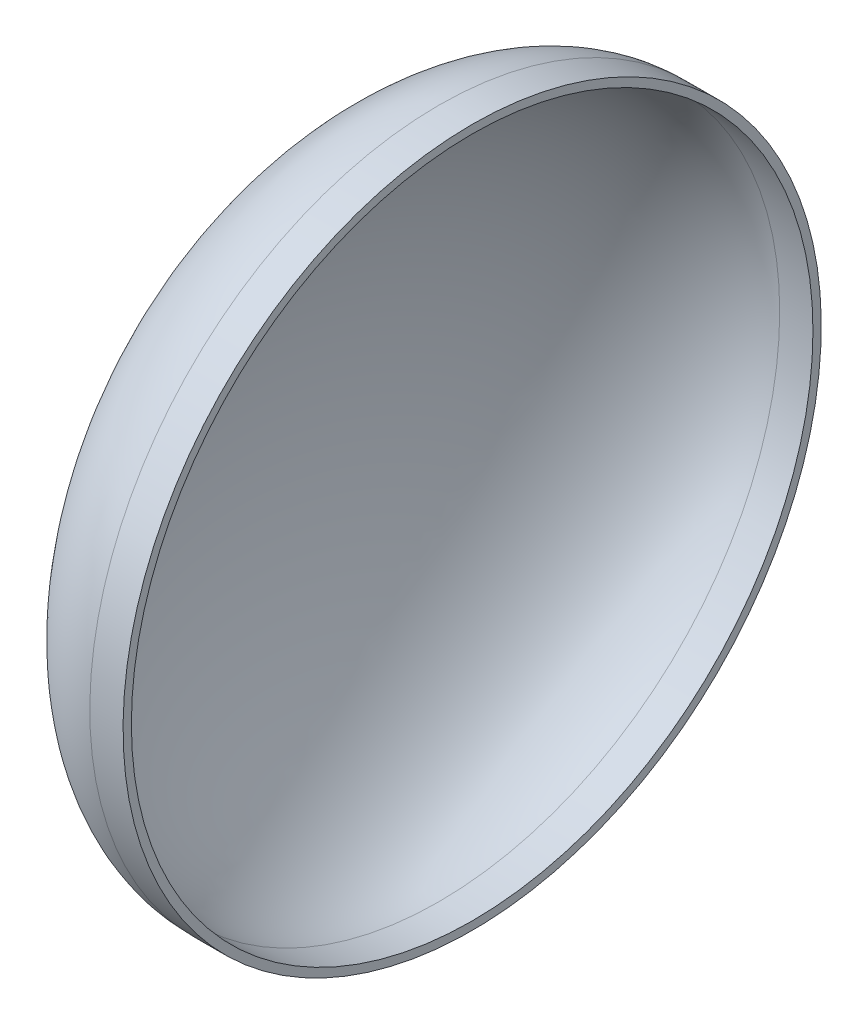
ISO-10303-21;
HEADER;
FILE_DESCRIPTION(('STEP AP214'),'2;1');
FILE_NAME('part.step','',(''),(''),'','','');
FILE_SCHEMA(('AUTOMOTIVE_DESIGN { 1 0 10303 214 1 1 1 1 }'));
ENDSEC;
DATA;
#1=APPLICATION_CONTEXT('core data for automotive mechanical design processes');
#2=APPLICATION_PROTOCOL_DEFINITION('international standard','automotive_design',2000,#1);
#3=PRODUCT_CONTEXT('',#1,'mechanical');
#4=PRODUCT('Part','Part','',(#3));
#5=PRODUCT_RELATED_PRODUCT_CATEGORY('part','',(#4));
#6=PRODUCT_DEFINITION_FORMATION('','',#4);
#7=PRODUCT_DEFINITION_CONTEXT('part definition',#1,'design');
#8=PRODUCT_DEFINITION('design','',#6,#7);
#9=PRODUCT_DEFINITION_SHAPE('','',#8);
#10=(LENGTH_UNIT() NAMED_UNIT(*) SI_UNIT(.MILLI.,.METRE.));
#11=(NAMED_UNIT(*) PLANE_ANGLE_UNIT() SI_UNIT($,.RADIAN.));
#12=(NAMED_UNIT(*) SI_UNIT($,.STERADIAN.) SOLID_ANGLE_UNIT());
#13=UNCERTAINTY_MEASURE_WITH_UNIT(LENGTH_MEASURE(1.E-05),#10,'distance_accuracy_value','');
#14=(GEOMETRIC_REPRESENTATION_CONTEXT(3) GLOBAL_UNCERTAINTY_ASSIGNED_CONTEXT((#13)) GLOBAL_UNIT_ASSIGNED_CONTEXT((#10,
#11,#12)) REPRESENTATION_CONTEXT('',''));
#15=CARTESIAN_POINT('',(0.,0.,0.));
#16=DIRECTION('',(0.,0.,1.));
#17=DIRECTION('',(1.,0.,0.));
#18=AXIS2_PLACEMENT_3D('',#15,#16,#17);
#19=CARTESIAN_POINT('',(-1879.6,0.,0.));
#20=DIRECTION('',(1.,0.,0.));
#21=DIRECTION('',(0.,1.,0.));
#22=AXIS2_PLACEMENT_3D('',#19,#20,#21);
#23=CYLINDRICAL_SURFACE('',#22,533.4);
#24=CARTESIAN_POINT('',(-1879.6,0.,0.));
#25=DIRECTION('',(1.,0.,0.));
#26=DIRECTION('',(0.,1.,0.));
#27=AXIS2_PLACEMENT_3D('',#24,#25,#26);
#28=CIRCLE('',#27,533.4);
#29=CARTESIAN_POINT('',(-1879.6,533.4,0.));
#30=VERTEX_POINT('',#29);
#31=EDGE_CURVE('E54',#30,#30,#28,.T.);
#32=ORIENTED_EDGE('',*,*,#31,.T.);
#33=EDGE_LOOP('',(#32));
#34=FACE_BOUND('',#33,.T.);
#35=CARTESIAN_POINT('',(-1828.8,0.,0.));
#36=DIRECTION('',(1.,0.,0.));
#37=DIRECTION('',(0.,1.,0.));
#38=AXIS2_PLACEMENT_3D('',#35,#36,#37);
#39=CIRCLE('',#38,533.4);
#40=CARTESIAN_POINT('',(-1828.8,533.4,0.));
#41=VERTEX_POINT('',#40);
#42=EDGE_CURVE('E11',#41,#41,#39,.T.);
#43=ORIENTED_EDGE('',*,*,#42,.F.);
#44=EDGE_LOOP('',(#43));
#45=FACE_BOUND('',#44,.T.);
#46=ADVANCED_FACE('F34',(#34,#45),#23,.T.);
#47=CARTESIAN_POINT('',(-1828.8,533.4,0.));
#48=DIRECTION('',(1.,0.,0.));
#49=DIRECTION('',(0.,1.,0.));
#50=AXIS2_PLACEMENT_3D('',#47,#48,#49);
#51=PLANE('',#50);
#52=ORIENTED_EDGE('',*,*,#42,.T.);
#53=EDGE_LOOP('',(#52));
#54=FACE_BOUND('',#53,.T.);
#55=CARTESIAN_POINT('',(-1828.8,0.,0.));
#56=DIRECTION('',(1.,0.,0.));
#57=DIRECTION('',(0.,1.,0.));
#58=AXIS2_PLACEMENT_3D('',#55,#56,#57);
#59=CIRCLE('',#58,520.7);
#60=CARTESIAN_POINT('',(-1828.8,520.7,0.));
#61=VERTEX_POINT('',#60);
#62=EDGE_CURVE('E41',#61,#61,#59,.T.);
#63=ORIENTED_EDGE('',*,*,#62,.F.);
#64=EDGE_LOOP('',(#63));
#65=FACE_BOUND('',#64,.T.);
#66=ADVANCED_FACE('F71',(#54,#65),#51,.T.);
#67=CARTESIAN_POINT('',(-1879.6,0.,0.));
#68=DIRECTION('',(1.,0.,0.));
#69=DIRECTION('',(0.,1.,0.));
#70=AXIS2_PLACEMENT_3D('',#67,#68,#69);
#71=CYLINDRICAL_SURFACE('',#70,520.7);
#72=ORIENTED_EDGE('',*,*,#62,.T.);
#73=EDGE_LOOP('',(#72));
#74=FACE_BOUND('',#73,.T.);
#75=CARTESIAN_POINT('',(-1879.6,0.,0.));
#76=DIRECTION('',(1.,0.,0.));
#77=DIRECTION('',(0.,1.,0.));
#78=AXIS2_PLACEMENT_3D('',#75,#76,#77);
#79=CIRCLE('',#78,520.7);
#80=CARTESIAN_POINT('',(-1879.6,520.7,0.));
#81=VERTEX_POINT('',#80);
#82=EDGE_CURVE('E56',#81,#81,#79,.T.);
#83=ORIENTED_EDGE('',*,*,#82,.F.);
#84=EDGE_LOOP('',(#83));
#85=FACE_BOUND('',#84,.T.);
#86=ADVANCED_FACE('F68',(#74,#85),#71,.F.);
#87=CARTESIAN_POINT('',(-2139.95,0.,0.));
#88=CARTESIAN_POINT('',(-2139.95,8.6184855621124,0.));
#89=CARTESIAN_POINT('',(-2139.73330269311,25.8653825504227,0.));
#90=CARTESIAN_POINT('',(-2138.43439355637,60.2634395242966,0.));
#91=CARTESIAN_POINT('',(-2135.19345334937,102.944784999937,0.));
#92=CARTESIAN_POINT('',(-2128.75611150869,153.141666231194,0.));
#93=CARTESIAN_POINT('',(-2116.86780519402,218.05021404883,0.));
#94=CARTESIAN_POINT('',(-2096.03203902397,294.17519134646,0.));
#95=CARTESIAN_POINT('',(-2062.53449917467,373.859954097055,0.));
#96=CARTESIAN_POINT('',(-2022.05371008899,438.687396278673,0.));
#97=CARTESIAN_POINT('',(-1984.13611353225,478.184705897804,0.));
#98=CARTESIAN_POINT('',(-1952.45342018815,500.303799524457,0.));
#99=CARTESIAN_POINT('',(-1928.29772991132,512.107717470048,0.));
#100=CARTESIAN_POINT('',(-1908.0273048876,517.971460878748,0.));
#101=CARTESIAN_POINT('',(-1891.78356429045,520.31063410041,0.));
#102=CARTESIAN_POINT('',(-1883.66623570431,520.7,0.));
#103=CARTESIAN_POINT('',(-1879.6,520.7,0.));
#104=B_SPLINE_CURVE_WITH_KNOTS('',3,(#87,#88,#89,#90,#91,#92,#93,#94,#95,#96,#97,#98,#99,#100,
#101,#102,#103),.UNSPECIFIED.,.F.,.F.,(4,1,1,1,1,1,1,1,1,1,1,1,1,1,4),(0.,0.0490873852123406,
0.0981747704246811,0.196349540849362,0.294524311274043,0.392699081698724,0.589048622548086,
0.785398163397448,0.98174770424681,1.17809724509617,1.27627201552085,1.37444678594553,
1.47262155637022,1.52170894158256,1.5707963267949),.UNSPECIFIED.);
#105=CARTESIAN_POINT('',(-1879.6,0.,0.));
#106=DIRECTION('',(1.,0.,0.));
#107=AXIS1_PLACEMENT('',#105,#106);
#108=SURFACE_OF_REVOLUTION('',#104,#107);
#109=ORIENTED_EDGE('',*,*,#82,.T.);
#110=EDGE_LOOP('',(#109));
#111=FACE_BOUND('',#110,.T.);
#112=CARTESIAN_POINT('',(-2139.95,0.,0.));
#113=VERTEX_POINT('',#112);
#114=VERTEX_LOOP('',#113);
#115=FACE_BOUND('',#114,.T.);
#116=ADVANCED_FACE('F50',(#111,#115),#108,.F.);
#117=CARTESIAN_POINT('',(-1879.6,0.,0.));
#118=DIRECTION('',(0.,0.,1.));
#119=DIRECTION('',(0.,1.,0.));
#120=AXIS2_PLACEMENT_3D('',#117,#118,#119);
#121=ELLIPSE('',#120,533.4,273.05);
#122=TRIMMED_CURVE('',#121,(PARAMETER_VALUE(-1.5707963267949)),
(PARAMETER_VALUE(1.5707963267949)),.T.,.PARAMETER.);
#123=CARTESIAN_POINT('',(-1879.6,0.,0.));
#124=DIRECTION('',(1.,0.,0.));
#125=AXIS1_PLACEMENT('',#123,#124);
#126=SURFACE_OF_REVOLUTION('',#122,#125);
#127=CARTESIAN_POINT('',(-2152.65,0.,0.));
#128=VERTEX_POINT('',#127);
#129=VERTEX_LOOP('',#128);
#130=FACE_BOUND('',#129,.T.);
#131=ORIENTED_EDGE('',*,*,#31,.F.);
#132=EDGE_LOOP('',(#131));
#133=FACE_BOUND('',#132,.T.);
#134=ADVANCED_FACE('F47',(#130,#133),#126,.F.);
#135=CLOSED_SHELL('',(#46,#66,#86,#116,#134));
#136=MANIFOLD_SOLID_BREP('B2',#135);
#137=ADVANCED_BREP_SHAPE_REPRESENTATION('',(#18,#136),#14);
#138=SHAPE_DEFINITION_REPRESENTATION(#9,#137);
ENDSEC;
END-ISO-10303-21;
